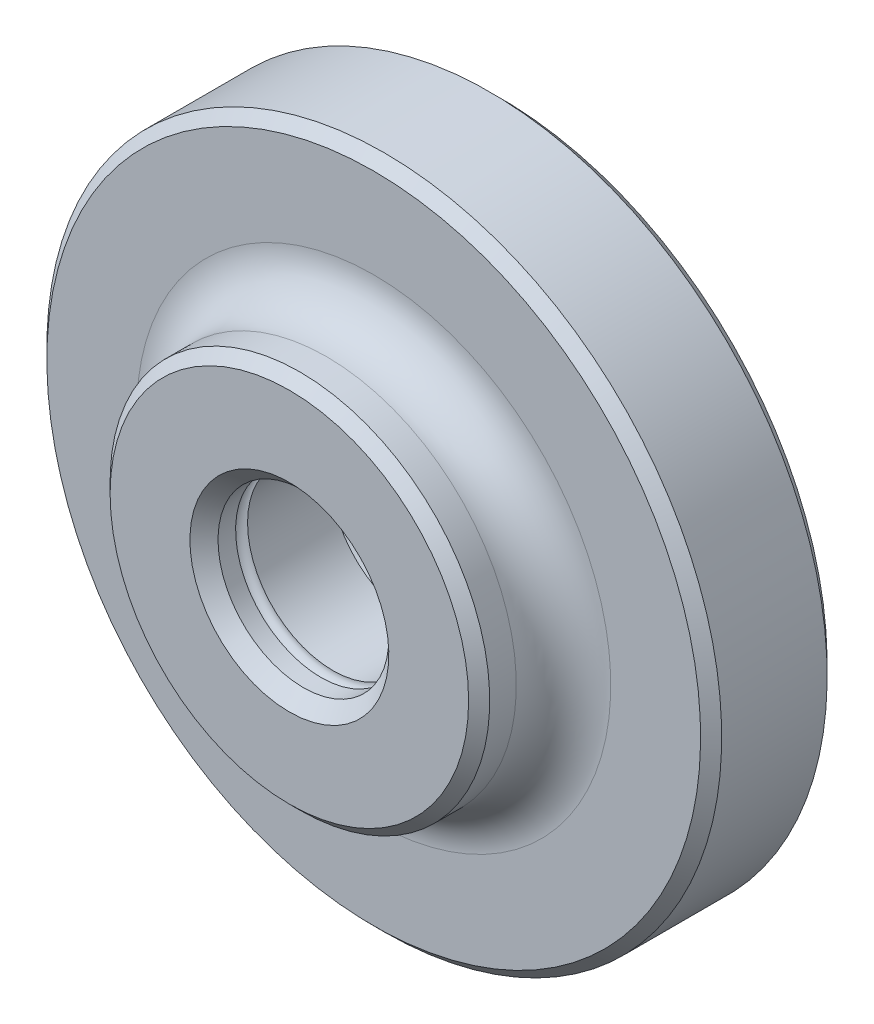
ISO-10303-21;
HEADER;
FILE_DESCRIPTION(('STEP AP214'),'2;1');
FILE_NAME('part.step','',(''),(''),'','','');
FILE_SCHEMA(('AUTOMOTIVE_DESIGN { 1 0 10303 214 1 1 1 1 }'));
ENDSEC;
DATA;
#1=APPLICATION_CONTEXT('core data for automotive mechanical design processes');
#2=APPLICATION_PROTOCOL_DEFINITION('international standard','automotive_design',2000,#1);
#3=PRODUCT_CONTEXT('',#1,'mechanical');
#4=PRODUCT('Part','Part','',(#3));
#5=PRODUCT_RELATED_PRODUCT_CATEGORY('part','',(#4));
#6=PRODUCT_DEFINITION_FORMATION('','',#4);
#7=PRODUCT_DEFINITION_CONTEXT('part definition',#1,'design');
#8=PRODUCT_DEFINITION('design','',#6,#7);
#9=PRODUCT_DEFINITION_SHAPE('','',#8);
#10=(LENGTH_UNIT() NAMED_UNIT(*) SI_UNIT(.MILLI.,.METRE.));
#11=(NAMED_UNIT(*) PLANE_ANGLE_UNIT() SI_UNIT($,.RADIAN.));
#12=(NAMED_UNIT(*) SI_UNIT($,.STERADIAN.) SOLID_ANGLE_UNIT());
#13=UNCERTAINTY_MEASURE_WITH_UNIT(LENGTH_MEASURE(1.E-05),#10,'distance_accuracy_value','');
#14=(GEOMETRIC_REPRESENTATION_CONTEXT(3) GLOBAL_UNCERTAINTY_ASSIGNED_CONTEXT((#13)) GLOBAL_UNIT_ASSIGNED_CONTEXT((#10,
#11,#12)) REPRESENTATION_CONTEXT('',''));
#15=CARTESIAN_POINT('',(0.,0.,0.));
#16=DIRECTION('',(0.,0.,1.));
#17=DIRECTION('',(1.,0.,0.));
#18=AXIS2_PLACEMENT_3D('',#15,#16,#17);
#19=CARTESIAN_POINT('',(0.,0.,4.00000000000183));
#20=DIRECTION('',(0.,0.,1.));
#21=DIRECTION('',(0.,-1.,0.));
#22=AXIS2_PLACEMENT_3D('',#19,#20,#21);
#23=CONICAL_SURFACE('',#22,4.049999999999,1.0471975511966);
#24=CARTESIAN_POINT('',(0.,0.,1.66173140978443));
#25=VERTEX_POINT('',#24);
#26=VERTEX_LOOP('',#25);
#27=FACE_BOUND('',#26,.T.);
#28=CARTESIAN_POINT('',(0.,0.,4.));
#29=DIRECTION('',(0.,0.,1.));
#30=DIRECTION('',(0.,-1.,0.));
#31=AXIS2_PLACEMENT_3D('',#28,#29,#30);
#32=CIRCLE('',#31,4.05);
#33=CARTESIAN_POINT('',(0.,-4.05,4.));
#34=VERTEX_POINT('',#33);
#35=EDGE_CURVE('E34',#34,#34,#32,.T.);
#36=ORIENTED_EDGE('',*,*,#35,.T.);
#37=EDGE_LOOP('',(#36));
#38=FACE_BOUND('',#37,.T.);
#39=ADVANCED_FACE('F14',(#27,#38),#23,.F.);
#40=CARTESIAN_POINT('',(0.,0.,0.));
#41=DIRECTION('',(0.,0.,1.));
#42=DIRECTION('',(0.,-1.,0.));
#43=AXIS2_PLACEMENT_3D('',#40,#41,#42);
#44=CYLINDRICAL_SURFACE('',#43,4.05);
#45=ORIENTED_EDGE('',*,*,#35,.F.);
#46=EDGE_LOOP('',(#45));
#47=FACE_BOUND('',#46,.T.);
#48=CARTESIAN_POINT('',(0.,0.,7.93333333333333));
#49=DIRECTION('',(0.,0.,-1.));
#50=DIRECTION('',(0.,1.,0.));
#51=AXIS2_PLACEMENT_3D('',#48,#49,#50);
#52=CIRCLE('',#51,4.05);
#53=CARTESIAN_POINT('',(0.,4.05,7.93333333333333));
#54=VERTEX_POINT('',#53);
#55=EDGE_CURVE('E36',#54,#54,#52,.F.);
#56=ORIENTED_EDGE('',*,*,#55,.T.);
#57=EDGE_LOOP('',(#56));
#58=FACE_BOUND('',#57,.T.);
#59=ADVANCED_FACE('F31',(#47,#58),#44,.F.);
#60=CARTESIAN_POINT('',(0.,0.,8.33333333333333));
#61=DIRECTION('',(0.,0.,-1.));
#62=DIRECTION('',(0.,1.,0.));
#63=AXIS2_PLACEMENT_3D('',#60,#61,#62);
#64=TOROIDAL_SURFACE('',#63,4.05,0.4);
#65=ORIENTED_EDGE('',*,*,#55,.F.);
#66=EDGE_LOOP('',(#65));
#67=FACE_BOUND('',#66,.T.);
#68=CARTESIAN_POINT('',(0.,0.,8.49568163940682));
#69=DIRECTION('',(0.,0.,-1.));
#70=DIRECTION('',(0.,1.,0.));
#71=AXIS2_PLACEMENT_3D('',#68,#69,#70);
#72=CIRCLE('',#71,4.41557219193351);
#73=CARTESIAN_POINT('',(0.,4.41557219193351,8.49568163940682));
#74=VERTEX_POINT('',#73);
#75=EDGE_CURVE('E39',#74,#74,#72,.F.);
#76=ORIENTED_EDGE('',*,*,#75,.T.);
#77=EDGE_LOOP('',(#76));
#78=FACE_BOUND('',#77,.T.);
#79=ADVANCED_FACE('F100',(#67,#78),#64,.F.);
#80=CARTESIAN_POINT('',(0.,0.,8.));
#81=DIRECTION('',(0.,0.,-1.));
#82=DIRECTION('',(0.,1.,0.));
#83=AXIS2_PLACEMENT_3D('',#80,#81,#82);
#84=TOROIDAL_SURFACE('',#83,4.35,0.5);
#85=ORIENTED_EDGE('',*,*,#75,.F.);
#86=EDGE_LOOP('',(#85));
#87=FACE_BOUND('',#86,.T.);
#88=CARTESIAN_POINT('',(0.,0.,8.5));
#89=DIRECTION('',(0.,0.,1.));
#90=DIRECTION('',(0.,1.,0.));
#91=AXIS2_PLACEMENT_3D('',#88,#89,#90);
#92=CIRCLE('',#91,4.35);
#93=CARTESIAN_POINT('',(0.,4.35,8.5));
#94=VERTEX_POINT('',#93);
#95=EDGE_CURVE('E67',#94,#94,#92,.T.);
#96=ORIENTED_EDGE('',*,*,#95,.T.);
#97=EDGE_LOOP('',(#96));
#98=FACE_BOUND('',#97,.T.);
#99=ADVANCED_FACE('F95',(#87,#98),#84,.F.);
#100=CARTESIAN_POINT('',(4.35,0.,8.5));
#101=DIRECTION('',(0.,0.,1.));
#102=DIRECTION('',(0.,-1.,0.));
#103=AXIS2_PLACEMENT_3D('',#100,#101,#102);
#104=PLANE('',#103);
#105=ORIENTED_EDGE('',*,*,#95,.F.);
#106=EDGE_LOOP('',(#105));
#107=FACE_BOUND('',#106,.T.);
#108=CARTESIAN_POINT('',(0.,0.,8.5));
#109=DIRECTION('',(0.,0.,1.));
#110=DIRECTION('',(0.,-1.,0.));
#111=AXIS2_PLACEMENT_3D('',#108,#109,#110);
#112=CIRCLE('',#111,4.05);
#113=CARTESIAN_POINT('',(0.,-4.05,8.5));
#114=VERTEX_POINT('',#113);
#115=EDGE_CURVE('E17',#114,#114,#112,.T.);
#116=ORIENTED_EDGE('',*,*,#115,.T.);
#117=EDGE_LOOP('',(#116));
#118=FACE_BOUND('',#117,.T.);
#119=ADVANCED_FACE('F84',(#107,#118),#104,.F.);
#120=CARTESIAN_POINT('',(0.,0.,0.));
#121=DIRECTION('',(0.,0.,1.));
#122=DIRECTION('',(0.,-1.,0.));
#123=AXIS2_PLACEMENT_3D('',#120,#121,#122);
#124=CYLINDRICAL_SURFACE('',#123,4.05);
#125=ORIENTED_EDGE('',*,*,#115,.F.);
#126=EDGE_LOOP('',(#125));
#127=FACE_BOUND('',#126,.T.);
#128=CARTESIAN_POINT('',(0.,0.,9.33400000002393));
#129=DIRECTION('',(0.,0.,1.));
#130=DIRECTION('',(0.,-1.,0.));
#131=AXIS2_PLACEMENT_3D('',#128,#129,#130);
#132=CIRCLE('',#131,4.05000000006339);
#133=CARTESIAN_POINT('',(0.,-4.05000000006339,9.33400000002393));
#134=VERTEX_POINT('',#133);
#135=EDGE_CURVE('E59',#134,#134,#132,.T.);
#136=ORIENTED_EDGE('',*,*,#135,.T.);
#137=EDGE_LOOP('',(#136));
#138=FACE_BOUND('',#137,.T.);
#139=ADVANCED_FACE('F94',(#127,#138),#124,.F.);
#140=CARTESIAN_POINT('',(0.,0.,9.99999999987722));
#141=DIRECTION('',(0.,0.,1.));
#142=DIRECTION('',(0.,-1.,0.));
#143=AXIS2_PLACEMENT_3D('',#140,#141,#142);
#144=CONICAL_SURFACE('',#143,4.71599999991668,0.785398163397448);
#145=ORIENTED_EDGE('',*,*,#135,.F.);
#146=EDGE_LOOP('',(#145));
#147=FACE_BOUND('',#146,.T.);
#148=CARTESIAN_POINT('',(0.,0.,9.99999999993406));
#149=DIRECTION('',(0.,0.,1.));
#150=DIRECTION('',(0.,-1.,0.));
#151=AXIS2_PLACEMENT_3D('',#148,#149,#150);
#152=CIRCLE('',#151,4.71599999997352);
#153=CARTESIAN_POINT('',(0.,-4.71599999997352,9.99999999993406));
#154=VERTEX_POINT('',#153);
#155=EDGE_CURVE('E57',#154,#154,#152,.T.);
#156=ORIENTED_EDGE('',*,*,#155,.T.);
#157=EDGE_LOOP('',(#156));
#158=FACE_BOUND('',#157,.T.);
#159=ADVANCED_FACE('F205',(#147,#158),#144,.F.);
#160=CARTESIAN_POINT('',(5.05,0.,10.));
#161=DIRECTION('',(0.,0.,-1.));
#162=DIRECTION('',(0.,1.,0.));
#163=AXIS2_PLACEMENT_3D('',#160,#161,#162);
#164=PLANE('',#163);
#165=ORIENTED_EDGE('',*,*,#155,.F.);
#166=EDGE_LOOP('',(#165));
#167=FACE_BOUND('',#166,.T.);
#168=CARTESIAN_POINT('',(0.,0.,10.));
#169=DIRECTION('',(0.,0.,-1.));
#170=DIRECTION('',(0.,1.,0.));
#171=AXIS2_PLACEMENT_3D('',#168,#169,#170);
#172=CIRCLE('',#171,8.5);
#173=CARTESIAN_POINT('',(0.,8.5,10.));
#174=VERTEX_POINT('',#173);
#175=EDGE_CURVE('E54',#174,#174,#172,.T.);
#176=ORIENTED_EDGE('',*,*,#175,.F.);
#177=EDGE_LOOP('',(#176));
#178=FACE_BOUND('',#177,.T.);
#179=ADVANCED_FACE('F197',(#167,#178),#164,.F.);
#180=CARTESIAN_POINT('',(0.,0.,9.5));
#181=DIRECTION('',(0.,0.,-1.));
#182=DIRECTION('',(0.,1.,0.));
#183=AXIS2_PLACEMENT_3D('',#180,#181,#182);
#184=CONICAL_SURFACE('',#183,9.,0.785398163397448);
#185=ORIENTED_EDGE('',*,*,#175,.T.);
#186=EDGE_LOOP('',(#185));
#187=FACE_BOUND('',#186,.T.);
#188=CARTESIAN_POINT('',(0.,0.,9.5));
#189=DIRECTION('',(0.,0.,1.));
#190=DIRECTION('',(0.,-1.,0.));
#191=AXIS2_PLACEMENT_3D('',#188,#189,#190);
#192=CIRCLE('',#191,9.);
#193=CARTESIAN_POINT('',(0.,-9.,9.5));
#194=VERTEX_POINT('',#193);
#195=EDGE_CURVE('E56',#194,#194,#192,.F.);
#196=ORIENTED_EDGE('',*,*,#195,.F.);
#197=EDGE_LOOP('',(#196));
#198=FACE_BOUND('',#197,.T.);
#199=ADVANCED_FACE('F195',(#187,#198),#184,.T.);
#200=CARTESIAN_POINT('',(0.,0.,0.));
#201=DIRECTION('',(0.,0.,1.));
#202=DIRECTION('',(0.,-1.,0.));
#203=AXIS2_PLACEMENT_3D('',#200,#201,#202);
#204=CYLINDRICAL_SURFACE('',#203,9.);
#205=ORIENTED_EDGE('',*,*,#195,.T.);
#206=EDGE_LOOP('',(#205));
#207=FACE_BOUND('',#206,.T.);
#208=CARTESIAN_POINT('',(0.,0.,8.24));
#209=DIRECTION('',(0.,0.,-1.));
#210=DIRECTION('',(0.,1.,0.));
#211=AXIS2_PLACEMENT_3D('',#208,#209,#210);
#212=CIRCLE('',#211,9.);
#213=CARTESIAN_POINT('',(0.,9.,8.24));
#214=VERTEX_POINT('',#213);
#215=EDGE_CURVE('E174',#214,#214,#212,.F.);
#216=ORIENTED_EDGE('',*,*,#215,.T.);
#217=EDGE_LOOP('',(#216));
#218=FACE_BOUND('',#217,.T.);
#219=ADVANCED_FACE('F192',(#207,#218),#204,.T.);
#220=CARTESIAN_POINT('',(0.,0.,8.24));
#221=DIRECTION('',(0.,0.,-1.));
#222=DIRECTION('',(0.,1.,0.));
#223=AXIS2_PLACEMENT_3D('',#220,#221,#222);
#224=TOROIDAL_SURFACE('',#223,11.24,2.24);
#225=ORIENTED_EDGE('',*,*,#215,.F.);
#226=EDGE_LOOP('',(#225));
#227=FACE_BOUND('',#226,.T.);
#228=CARTESIAN_POINT('',(0.,0.,6.));
#229=DIRECTION('',(0.,0.,1.));
#230=DIRECTION('',(0.,1.,0.));
#231=AXIS2_PLACEMENT_3D('',#228,#229,#230);
#232=CIRCLE('',#231,11.24);
#233=CARTESIAN_POINT('',(0.,11.24,6.));
#234=VERTEX_POINT('',#233);
#235=EDGE_CURVE('E53',#234,#234,#232,.T.);
#236=ORIENTED_EDGE('',*,*,#235,.T.);
#237=EDGE_LOOP('',(#236));
#238=FACE_BOUND('',#237,.T.);
#239=ADVANCED_FACE('F156',(#227,#238),#224,.F.);
#240=CARTESIAN_POINT('',(11.,0.,6.));
#241=DIRECTION('',(0.,0.,-1.));
#242=DIRECTION('',(0.,1.,0.));
#243=AXIS2_PLACEMENT_3D('',#240,#241,#242);
#244=PLANE('',#243);
#245=ORIENTED_EDGE('',*,*,#235,.F.);
#246=EDGE_LOOP('',(#245));
#247=FACE_BOUND('',#246,.T.);
#248=CARTESIAN_POINT('',(0.,0.,6.));
#249=DIRECTION('',(0.,0.,-1.));
#250=DIRECTION('',(0.,1.,0.));
#251=AXIS2_PLACEMENT_3D('',#248,#249,#250);
#252=CIRCLE('',#251,15.5);
#253=CARTESIAN_POINT('',(0.,15.5,6.));
#254=VERTEX_POINT('',#253);
#255=EDGE_CURVE('E49',#254,#254,#252,.T.);
#256=ORIENTED_EDGE('',*,*,#255,.F.);
#257=EDGE_LOOP('',(#256));
#258=FACE_BOUND('',#257,.T.);
#259=ADVANCED_FACE('F151',(#247,#258),#244,.F.);
#260=CARTESIAN_POINT('',(0.,0.,5.5));
#261=DIRECTION('',(0.,0.,-1.));
#262=DIRECTION('',(0.,1.,0.));
#263=AXIS2_PLACEMENT_3D('',#260,#261,#262);
#264=CONICAL_SURFACE('',#263,16.,0.785398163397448);
#265=ORIENTED_EDGE('',*,*,#255,.T.);
#266=EDGE_LOOP('',(#265));
#267=FACE_BOUND('',#266,.T.);
#268=CARTESIAN_POINT('',(0.,0.,5.5));
#269=DIRECTION('',(0.,0.,1.));
#270=DIRECTION('',(0.,-1.,0.));
#271=AXIS2_PLACEMENT_3D('',#268,#269,#270);
#272=CIRCLE('',#271,16.);
#273=CARTESIAN_POINT('',(0.,-16.,5.5));
#274=VERTEX_POINT('',#273);
#275=EDGE_CURVE('E52',#274,#274,#272,.F.);
#276=ORIENTED_EDGE('',*,*,#275,.F.);
#277=EDGE_LOOP('',(#276));
#278=FACE_BOUND('',#277,.T.);
#279=ADVANCED_FACE('F147',(#267,#278),#264,.T.);
#280=CARTESIAN_POINT('',(0.,0.,0.));
#281=DIRECTION('',(0.,0.,1.));
#282=DIRECTION('',(0.,-1.,0.));
#283=AXIS2_PLACEMENT_3D('',#280,#281,#282);
#284=CYLINDRICAL_SURFACE('',#283,16.);
#285=ORIENTED_EDGE('',*,*,#275,.T.);
#286=EDGE_LOOP('',(#285));
#287=FACE_BOUND('',#286,.T.);
#288=CARTESIAN_POINT('',(0.,0.,0.5));
#289=DIRECTION('',(0.,0.,1.));
#290=DIRECTION('',(0.,-1.,0.));
#291=AXIS2_PLACEMENT_3D('',#288,#289,#290);
#292=CIRCLE('',#291,16.);
#293=CARTESIAN_POINT('',(0.,-16.,0.499999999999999));
#294=VERTEX_POINT('',#293);
#295=EDGE_CURVE('E48',#294,#294,#292,.F.);
#296=ORIENTED_EDGE('',*,*,#295,.F.);
#297=EDGE_LOOP('',(#296));
#298=FACE_BOUND('',#297,.T.);
#299=ADVANCED_FACE('F144',(#287,#298),#284,.T.);
#300=CARTESIAN_POINT('',(0.,0.,3.99680288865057E-12));
#301=DIRECTION('',(0.,0.,-1.));
#302=DIRECTION('',(0.,1.,0.));
#303=AXIS2_PLACEMENT_3D('',#300,#301,#302);
#304=CONICAL_SURFACE('',#303,0.998567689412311,1.02974425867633);
#305=CARTESIAN_POINT('',(0.,-2.22044604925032E-13,0.600000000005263));
#306=VERTEX_POINT('',#305);
#307=VERTEX_LOOP('',#306);
#308=FACE_BOUND('',#307,.T.);
#309=CARTESIAN_POINT('',(0.,0.,3.86338502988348E-12));
#310=DIRECTION('',(0.,0.,-1.));
#311=DIRECTION('',(0.,1.,0.));
#312=AXIS2_PLACEMENT_3D('',#309,#310,#311);
#313=CIRCLE('',#312,0.998567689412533);
#314=CARTESIAN_POINT('',(0.,0.998567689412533,3.86338502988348E-12));
#315=VERTEX_POINT('',#314);
#316=EDGE_CURVE('E23',#315,#315,#313,.T.);
#317=ORIENTED_EDGE('',*,*,#316,.T.);
#318=EDGE_LOOP('',(#317));
#319=FACE_BOUND('',#318,.T.);
#320=ADVANCED_FACE('F136',(#308,#319),#304,.F.);
#321=CARTESIAN_POINT('',(0.,0.,0.5));
#322=DIRECTION('',(0.,0.,1.));
#323=DIRECTION('',(0.,-1.,0.));
#324=AXIS2_PLACEMENT_3D('',#321,#322,#323);
#325=CONICAL_SURFACE('',#324,16.,0.785398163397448);
#326=ORIENTED_EDGE('',*,*,#295,.T.);
#327=EDGE_LOOP('',(#326));
#328=FACE_BOUND('',#327,.T.);
#329=CARTESIAN_POINT('',(0.,0.,0.));
#330=DIRECTION('',(0.,0.,1.));
#331=DIRECTION('',(0.,-1.,0.));
#332=AXIS2_PLACEMENT_3D('',#329,#330,#331);
#333=CIRCLE('',#332,15.5);
#334=CARTESIAN_POINT('',(0.,-15.5,0.));
#335=VERTEX_POINT('',#334);
#336=EDGE_CURVE('E9',#335,#335,#333,.T.);
#337=ORIENTED_EDGE('',*,*,#336,.T.);
#338=EDGE_LOOP('',(#337));
#339=FACE_BOUND('',#338,.T.);
#340=ADVANCED_FACE('F129',(#328,#339),#325,.T.);
#341=CARTESIAN_POINT('',(15.5,0.,0.));
#342=DIRECTION('',(0.,0.,1.));
#343=DIRECTION('',(0.,-1.,0.));
#344=AXIS2_PLACEMENT_3D('',#341,#342,#343);
#345=PLANE('',#344);
#346=ORIENTED_EDGE('',*,*,#336,.F.);
#347=EDGE_LOOP('',(#346));
#348=FACE_BOUND('',#347,.T.);
#349=ORIENTED_EDGE('',*,*,#316,.F.);
#350=EDGE_LOOP('',(#349));
#351=FACE_BOUND('',#350,.T.);
#352=ADVANCED_FACE('F127',(#348,#351),#345,.F.);
#353=CLOSED_SHELL('',(#39,#59,#79,#99,#119,#139,#159,#179,#199,#219,#239,#259,#279,#299,#320,
#340,#352));
#354=MANIFOLD_SOLID_BREP('B1',#353);
#355=ADVANCED_BREP_SHAPE_REPRESENTATION('',(#18,#354),#14);
#356=SHAPE_DEFINITION_REPRESENTATION(#9,#355);
ENDSEC;
END-ISO-10303-21;
